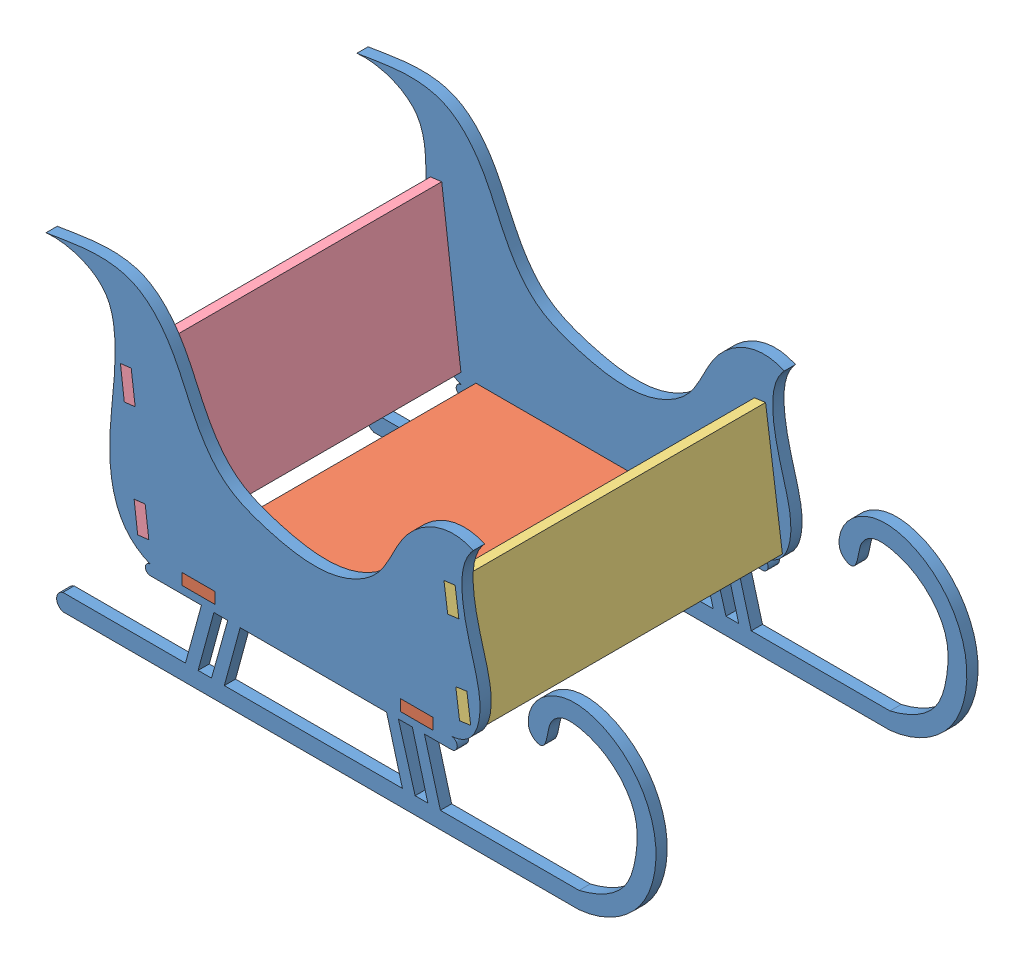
SolidWorks assembly traineau.SLDASM, configuration Défaut (file format 7000). Lengths in mm.
Overall size (163.1 89.74 86).
5 component instances, 4 part files, 15 mates.
Components (placement in the parent):
- flanc-1: flanc.SLDPRT [Défaut] at (-5.7152 3.4724 163.1037) size (163.1 89.74 3)
- flanc-2: flanc.SLDPRT [Défaut] at (-5.7152 3.4724 80.1037) size (163.1 89.74 3)
- fond-1: fond.SLDPRT [Défaut] at (-5.7152 -35.5647 163.1037) x (1 0 0) z (0 1 0) size (75 86 3)
- av-1: av.SLDPRT [Défaut] at (11.133 5.7843 163.1037) x (0 0 -1) z (0.990716 0.135947 0) size (86 33.09 3)
- ar-1: ar.SLDPRT [Défaut] at (-73.0002 -4.8293 163.1037) x (0 0 -1) z (0.992474 0.122452 0) size (86 41.83 3)
Mates (geometry in assembly coordinates):
- Coïncidente1: coincident aligned: plane of flanc-1 through (-70.8796 -22.0171 166.1037) normal (0.992474 0.122452 0); plane of flanc-2 through (-70.8796 -22.0171 83.1037) normal (0.992474 0.122452 0)
- Coïncidente2: coincident aligned: plane of flanc-1 through (-69.919 -29.8023 166.1037) normal (-0.122452 0.992474 0); plane of flanc-2 through (-69.919 -29.8023 83.1037) normal (-0.122452 0.992474 0)
- Distance1: distance = 80 mm anti-aligned: plane of flanc-2 through (-89.2343 -55.3161 83.1037) normal (0 0 1); plane of flanc-1 through (-89.2343 -55.3161 163.1037) normal (0 0 -1)
- Sur place1: in place: plane of flanc-1 through (-58.0484 -35.5647 166.1037) normal (0 1 0); plane of ? through (0 -35.5647 0) normal (0 1 0); moOrthogonalPlaneRef_w of flanc-1 through (-58.0484 -35.5647 166.1037) normal (0 1 0); plane of ? through (0 -35.5647 0) normal (0 0 -1); plane of flanc-1 through (-58.0484 -35.5647 166.1037) normal (0 1 0); line of ? through (-55 0 -35.5647) axis (0 1 0); plane of flanc-1 through (-58.0484 -35.5647 166.1037) normal (0 1 0); unknown of fond-1
- Coïncidente4: coincident aligned: plane of flanc-1; plane of fond-1
- Coïncidente5: coincident aligned: moOrthogonalPlaneRef_w of flanc-1 through (-5.7152 -35.5647 163.1037) normal (0 0 -1); plane of fond-1 through (-5.7152 -35.5647 163.1037) normal (0 0 -1)
- Coïncidente6: coincident anti-aligned: moOrthogonalPlaneRef_w of flanc-1 through (-5.7152 -35.5647 163.1037) normal (-1 0 0); plane of fond-1
- Sur place2: in place: plane of flanc-1 through (11.852 0.5447 166.1037) normal (0.990716 0.135947 0); plane of ? through (11.7063 1.6064 0) normal (0.990716 0.135947 0); plane of flanc-1 through (11.852 0.5447 166.1037) normal (0.990716 0.135947 0); line of ? through (-55 11.7063 1.6064) axis (0 -0.135947 0.990716); plane of flanc-1 through (11.852 0.5447 166.1037) normal (0.990716 0.135947 0); unknown of ?; plane of flanc-1 through (11.852 0.5447 166.1037) normal (0.990716 0.135947 0); unknown of av-1
- Coïncidente7: coincident aligned: plane of flanc-1; plane of av-1
- Coïncidente8: coincident aligned: moOrthogonalPlaneRef_w of flanc-1 through (11.133 5.7843 163.1037) normal (-0.135947 0.990716 0); plane of av-1
- Coïncidente9: coincident anti-aligned: moOrthogonalPlaneRef_w of flanc-1 through (11.133 5.7843 163.1037) normal (0 0 1); plane of av-1
- Sur place3: in place: plane of flanc-1 through (-74.5262 7.5389 166.1037) normal (0.992474 0.122452 0); plane of ? through (-72.4925 -8.9442 0) normal (0.992474 0.122452 0); plane of flanc-1 through (-74.5262 7.5389 166.1037) normal (0.992474 0.122452 0); line of ? through (-55 -72.4925 -8.9442) axis (0 -0.122452 0.992474); plane of flanc-1 through (-74.5262 7.5389 166.1037) normal (0.992474 0.122452 0); unknown of ?; plane of flanc-1 through (-74.5262 7.5389 166.1037) normal (0.992474 0.122452 0); unknown of ar-1
- Coïncidente10: coincident aligned: plane of flanc-1; plane of ar-1
- Coïncidente11: coincident aligned: moOrthogonalPlaneRef_w of flanc-1 through (-73.0002 -4.8293 163.1037) normal (-0.122452 0.992474 0); plane of ar-1
- Coïncidente12: coincident anti-aligned: moOrthogonalPlaneRef_w of flanc-1 through (-73.0002 -4.8293 163.1037) normal (0 0 1); plane of ar-1
